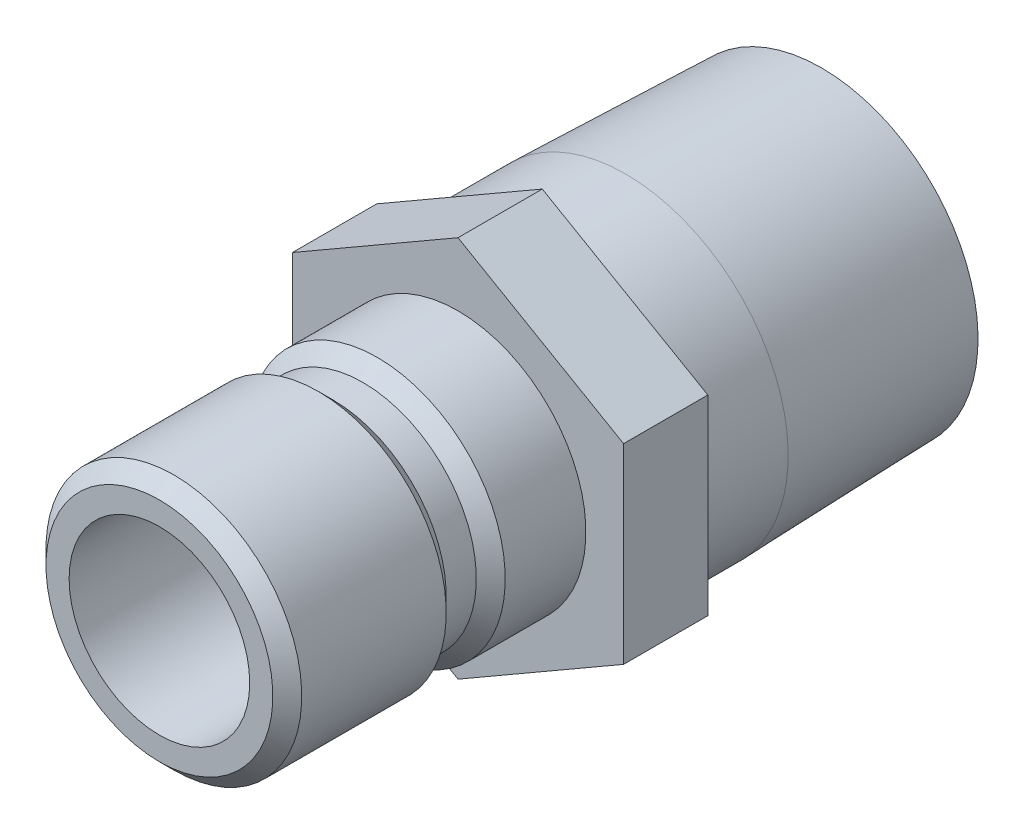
from build123d import *

# Parameters (mm, degrees)
SKETCH2_R           = 6.2611
BOSS_EXTRUDE1_DEPTH = 4.445


with BuildPart() as part:
    # Sketch1 → Revolve1 (revolve)
    with BuildSketch(Plane(origin=(0, 0, 0), x_dir=(0, 0, -1), z_dir=(1, 0, 0))):
        Polygon((-15.748, 4.7625), (-15.748, 5.9817), (-14.986, 6.7437), (-7.366, 6.7437), (-6.604, 5.9817), (-5.0165, 5.9817), (-4.2545, 6.7437), (0, 6.7437), (0, 8.5725), (8.8392, 8.5725), (19.177, 8.249445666), (19.177, 6.2611), (0.923819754, 6.2611), (0.127, 4.7625), align=None)
    revolve(axis=Axis((0, 0, 0), (0, 0, 1)))

    # Sketch2 → Boss-Extrude1 (add)
    with BuildSketch(Plane.XY):
        Polygon((-8.73125, 5.040989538), (-8.73125, -5.040989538), (0, -10.081979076), (8.73125, -5.040989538), (8.73125, 5.040989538), (0, 10.081979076), align=None)
        with Locations(Location((0, 0, 0), (0, 0, 90))):
            Circle(SKETCH2_R, mode=Mode.SUBTRACT)
    extrude(amount=-BOSS_EXTRUDE1_DEPTH)


solid = part.part
